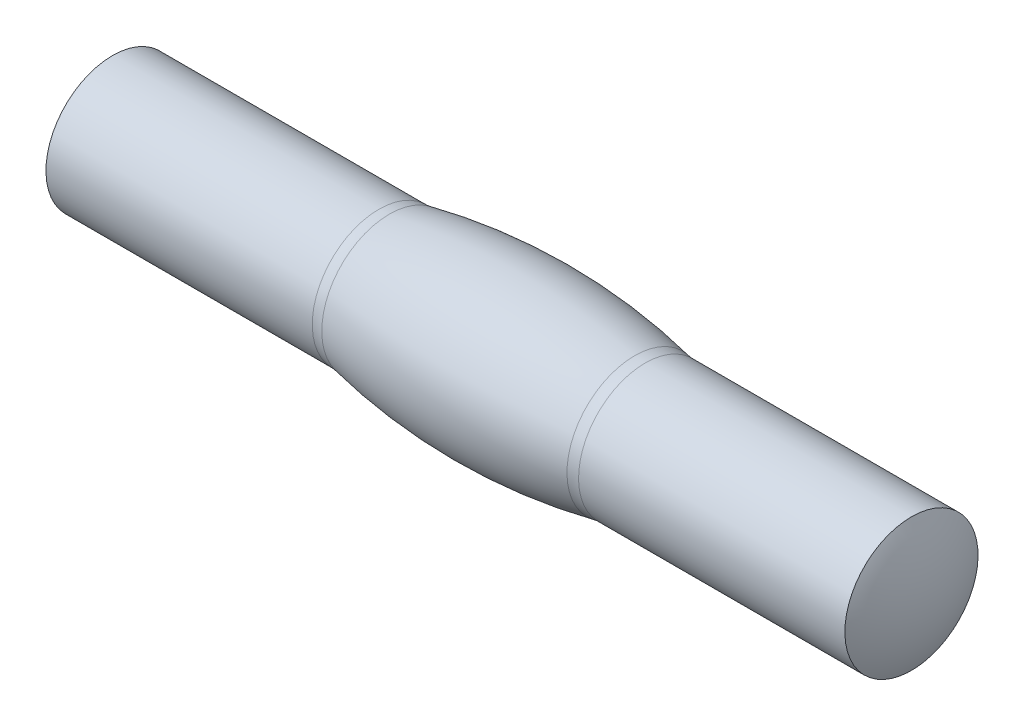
ISO-10303-21;
HEADER;
FILE_DESCRIPTION(('STEP AP214'),'2;1');
FILE_NAME('part.step','',(''),(''),'','','');
FILE_SCHEMA(('AUTOMOTIVE_DESIGN { 1 0 10303 214 1 1 1 1 }'));
ENDSEC;
DATA;
#1=APPLICATION_CONTEXT('core data for automotive mechanical design processes');
#2=APPLICATION_PROTOCOL_DEFINITION('international standard','automotive_design',2000,#1);
#3=PRODUCT_CONTEXT('',#1,'mechanical');
#4=PRODUCT('Part','Part','',(#3));
#5=PRODUCT_RELATED_PRODUCT_CATEGORY('part','',(#4));
#6=PRODUCT_DEFINITION_FORMATION('','',#4);
#7=PRODUCT_DEFINITION_CONTEXT('part definition',#1,'design');
#8=PRODUCT_DEFINITION('design','',#6,#7);
#9=PRODUCT_DEFINITION_SHAPE('','',#8);
#10=(LENGTH_UNIT() NAMED_UNIT(*) SI_UNIT(.MILLI.,.METRE.));
#11=(NAMED_UNIT(*) PLANE_ANGLE_UNIT() SI_UNIT($,.RADIAN.));
#12=(NAMED_UNIT(*) SI_UNIT($,.STERADIAN.) SOLID_ANGLE_UNIT());
#13=UNCERTAINTY_MEASURE_WITH_UNIT(LENGTH_MEASURE(1.E-05),#10,'distance_accuracy_value','');
#14=(GEOMETRIC_REPRESENTATION_CONTEXT(3) GLOBAL_UNCERTAINTY_ASSIGNED_CONTEXT((#13)) GLOBAL_UNIT_ASSIGNED_CONTEXT((#10,
#11,#12)) REPRESENTATION_CONTEXT('',''));
#15=CARTESIAN_POINT('',(0.,0.,0.));
#16=DIRECTION('',(0.,0.,1.));
#17=DIRECTION('',(1.,0.,0.));
#18=AXIS2_PLACEMENT_3D('',#15,#16,#17);
#19=CARTESIAN_POINT('',(5.,0.,0.));
#20=DIRECTION('',(1.,0.,0.));
#21=DIRECTION('',(0.,1.,0.));
#22=AXIS2_PLACEMENT_3D('',#19,#20,#21);
#23=TOROIDAL_SURFACE('',#22,4.5,2.);
#24=CARTESIAN_POINT('',(4.6039603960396,0.,0.));
#25=DIRECTION('',(1.,0.,0.));
#26=DIRECTION('',(0.,1.,0.));
#27=AXIS2_PLACEMENT_3D('',#24,#25,#26);
#28=CIRCLE('',#27,2.53960396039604);
#29=CARTESIAN_POINT('',(4.6039603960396,2.53960396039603,0.));
#30=VERTEX_POINT('',#29);
#31=EDGE_CURVE('E52',#30,#30,#28,.T.);
#32=ORIENTED_EDGE('',*,*,#31,.T.);
#33=EDGE_LOOP('',(#32));
#34=FACE_BOUND('',#33,.T.);
#35=CARTESIAN_POINT('',(5.,0.,0.));
#36=DIRECTION('',(1.,0.,0.));
#37=DIRECTION('',(0.,1.,0.));
#38=AXIS2_PLACEMENT_3D('',#35,#36,#37);
#39=CIRCLE('',#38,2.5);
#40=CARTESIAN_POINT('',(5.,2.49999999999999,0.));
#41=VERTEX_POINT('',#40);
#42=EDGE_CURVE('E10',#41,#41,#39,.T.);
#43=ORIENTED_EDGE('',*,*,#42,.F.);
#44=EDGE_LOOP('',(#43));
#45=FACE_BOUND('',#44,.T.);
#46=ADVANCED_FACE('F30',(#34,#45),#23,.F.);
#47=CARTESIAN_POINT('',(46.6153913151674,0.,0.));
#48=DIRECTION('',(1.,0.,0.));
#49=DIRECTION('',(0.,1.,0.));
#50=AXIS2_PLACEMENT_3D('',#47,#48,#49);
#51=CYLINDRICAL_SURFACE('',#50,2.5);
#52=ORIENTED_EDGE('',*,*,#42,.T.);
#53=EDGE_LOOP('',(#52));
#54=FACE_BOUND('',#53,.T.);
#55=CARTESIAN_POINT('',(15.,0.,0.));
#56=DIRECTION('',(1.,0.,0.));
#57=DIRECTION('',(0.,1.,0.));
#58=AXIS2_PLACEMENT_3D('',#55,#56,#57);
#59=CIRCLE('',#58,2.5);
#60=CARTESIAN_POINT('',(15.,2.49999999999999,0.));
#61=VERTEX_POINT('',#60);
#62=EDGE_CURVE('E36',#61,#61,#59,.T.);
#63=ORIENTED_EDGE('',*,*,#62,.F.);
#64=EDGE_LOOP('',(#63));
#65=FACE_BOUND('',#64,.T.);
#66=ADVANCED_FACE('F70',(#54,#65),#51,.T.);
#67=CARTESIAN_POINT('',(10.0916666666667,0.,0.));
#68=DIRECTION('',(1.,0.,0.));
#69=DIRECTION('',(0.,1.,0.));
#70=AXIS2_PLACEMENT_3D('',#67,#68,#69);
#71=SPHERICAL_SURFACE('',#70,5.50833333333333);
#72=ORIENTED_EDGE('',*,*,#62,.T.);
#73=EDGE_LOOP('',(#72));
#74=FACE_BOUND('',#73,.T.);
#75=ADVANCED_FACE('F74',(#74),#71,.T.);
#76=CARTESIAN_POINT('',(-10.0916666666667,0.,0.));
#77=DIRECTION('',(1.,0.,0.));
#78=DIRECTION('',(0.,1.,0.));
#79=AXIS2_PLACEMENT_3D('',#76,#77,#78);
#80=SPHERICAL_SURFACE('',#79,5.50833333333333);
#81=CARTESIAN_POINT('',(-15.,0.,0.));
#82=DIRECTION('',(1.,0.,0.));
#83=DIRECTION('',(0.,1.,0.));
#84=AXIS2_PLACEMENT_3D('',#81,#82,#83);
#85=CIRCLE('',#84,2.5);
#86=CARTESIAN_POINT('',(-15.,2.49999999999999,0.));
#87=VERTEX_POINT('',#86);
#88=EDGE_CURVE('E40',#87,#87,#85,.T.);
#89=ORIENTED_EDGE('',*,*,#88,.F.);
#90=EDGE_LOOP('',(#89));
#91=FACE_BOUND('',#90,.T.);
#92=ADVANCED_FACE('F78',(#91),#80,.T.);
#93=CARTESIAN_POINT('',(46.6153913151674,0.,0.));
#94=DIRECTION('',(1.,0.,0.));
#95=DIRECTION('',(0.,1.,0.));
#96=AXIS2_PLACEMENT_3D('',#93,#94,#95);
#97=CYLINDRICAL_SURFACE('',#96,2.5);
#98=ORIENTED_EDGE('',*,*,#88,.T.);
#99=EDGE_LOOP('',(#98));
#100=FACE_BOUND('',#99,.T.);
#101=CARTESIAN_POINT('',(-5.,0.,0.));
#102=DIRECTION('',(1.,0.,0.));
#103=DIRECTION('',(0.,1.,0.));
#104=AXIS2_PLACEMENT_3D('',#101,#102,#103);
#105=CIRCLE('',#104,2.5);
#106=CARTESIAN_POINT('',(-5.,2.49999999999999,0.));
#107=VERTEX_POINT('',#106);
#108=EDGE_CURVE('E44',#107,#107,#105,.T.);
#109=ORIENTED_EDGE('',*,*,#108,.F.);
#110=EDGE_LOOP('',(#109));
#111=FACE_BOUND('',#110,.T.);
#112=ADVANCED_FACE('F66',(#100,#111),#97,.T.);
#113=CARTESIAN_POINT('',(-5.,0.,0.));
#114=DIRECTION('',(1.,0.,0.));
#115=DIRECTION('',(0.,1.,0.));
#116=AXIS2_PLACEMENT_3D('',#113,#114,#115);
#117=TOROIDAL_SURFACE('',#116,4.5,2.);
#118=ORIENTED_EDGE('',*,*,#108,.T.);
#119=EDGE_LOOP('',(#118));
#120=FACE_BOUND('',#119,.T.);
#121=CARTESIAN_POINT('',(-4.6039603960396,0.,0.));
#122=DIRECTION('',(1.,0.,0.));
#123=DIRECTION('',(0.,1.,0.));
#124=AXIS2_PLACEMENT_3D('',#121,#122,#123);
#125=CIRCLE('',#124,2.53960396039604);
#126=CARTESIAN_POINT('',(-4.6039603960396,2.53960396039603,0.));
#127=VERTEX_POINT('',#126);
#128=EDGE_CURVE('E49',#127,#127,#125,.T.);
#129=ORIENTED_EDGE('',*,*,#128,.F.);
#130=EDGE_LOOP('',(#129));
#131=FACE_BOUND('',#130,.T.);
#132=ADVANCED_FACE('F60',(#120,#131),#117,.F.);
#133=CARTESIAN_POINT('',(0.,0.,0.));
#134=DIRECTION('',(1.,0.,0.));
#135=DIRECTION('',(0.,1.,0.));
#136=AXIS2_PLACEMENT_3D('',#133,#134,#135);
#137=DEGENERATE_TOROIDAL_SURFACE('',#136,20.25,23.25,.F.);
#138=ORIENTED_EDGE('',*,*,#128,.T.);
#139=EDGE_LOOP('',(#138));
#140=FACE_BOUND('',#139,.T.);
#141=ORIENTED_EDGE('',*,*,#31,.F.);
#142=EDGE_LOOP('',(#141));
#143=FACE_BOUND('',#142,.T.);
#144=ADVANCED_FACE('F58',(#140,#143),#137,.F.);
#145=CLOSED_SHELL('',(#46,#66,#75,#92,#112,#132,#144));
#146=MANIFOLD_SOLID_BREP('B2',#145);
#147=ADVANCED_BREP_SHAPE_REPRESENTATION('',(#18,#146),#14);
#148=SHAPE_DEFINITION_REPRESENTATION(#9,#147);
ENDSEC;
END-ISO-10303-21;
